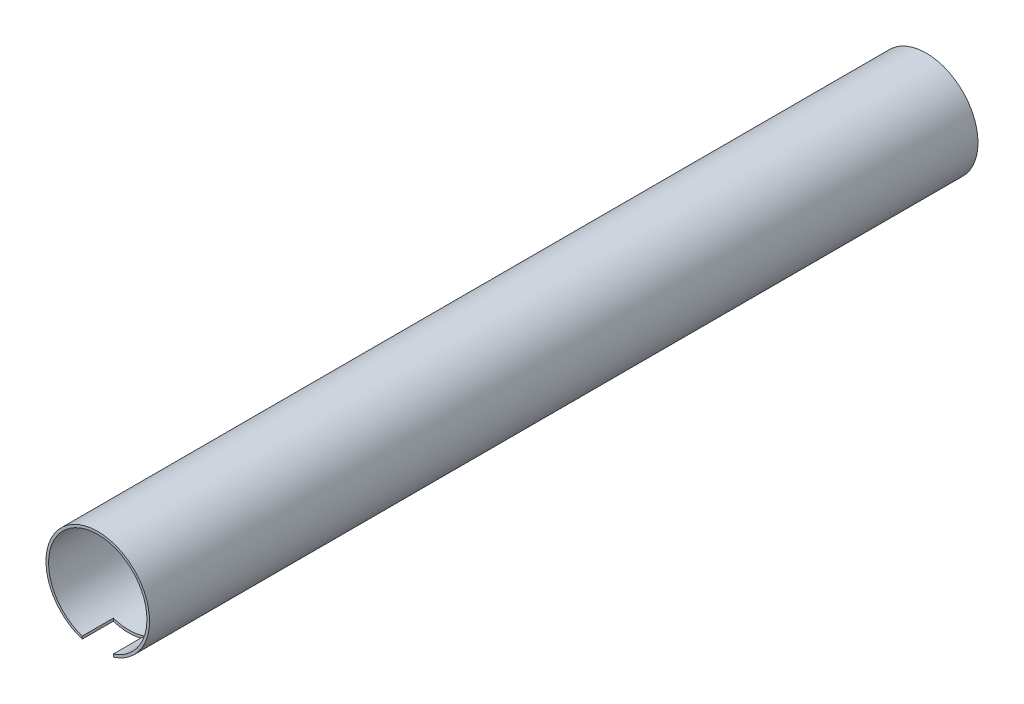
ISO-10303-21;
HEADER;
FILE_DESCRIPTION(('STEP AP214'),'2;1');
FILE_NAME('part.step','',(''),(''),'','','');
FILE_SCHEMA(('AUTOMOTIVE_DESIGN { 1 0 10303 214 1 1 1 1 }'));
ENDSEC;
DATA;
#1=APPLICATION_CONTEXT('core data for automotive mechanical design processes');
#2=APPLICATION_PROTOCOL_DEFINITION('international standard','automotive_design',2000,#1);
#3=PRODUCT_CONTEXT('',#1,'mechanical');
#4=PRODUCT('Part','Part','',(#3));
#5=PRODUCT_RELATED_PRODUCT_CATEGORY('part','',(#4));
#6=PRODUCT_DEFINITION_FORMATION('','',#4);
#7=PRODUCT_DEFINITION_CONTEXT('part definition',#1,'design');
#8=PRODUCT_DEFINITION('design','',#6,#7);
#9=PRODUCT_DEFINITION_SHAPE('','',#8);
#10=(LENGTH_UNIT() NAMED_UNIT(*) SI_UNIT(.MILLI.,.METRE.));
#11=(NAMED_UNIT(*) PLANE_ANGLE_UNIT() SI_UNIT($,.RADIAN.));
#12=(NAMED_UNIT(*) SI_UNIT($,.STERADIAN.) SOLID_ANGLE_UNIT());
#13=UNCERTAINTY_MEASURE_WITH_UNIT(LENGTH_MEASURE(1.E-05),#10,'distance_accuracy_value','');
#14=(GEOMETRIC_REPRESENTATION_CONTEXT(3) GLOBAL_UNCERTAINTY_ASSIGNED_CONTEXT((#13)) GLOBAL_UNIT_ASSIGNED_CONTEXT((#10,
#11,#12)) REPRESENTATION_CONTEXT('',''));
#15=CARTESIAN_POINT('',(0.,0.,0.));
#16=DIRECTION('',(0.,0.,1.));
#17=DIRECTION('',(1.,0.,0.));
#18=AXIS2_PLACEMENT_3D('',#15,#16,#17);
#19=CARTESIAN_POINT('',(0.,0.,800.));
#20=DIRECTION('',(0.,0.,1.));
#21=DIRECTION('',(1.,0.,0.));
#22=AXIS2_PLACEMENT_3D('',#19,#20,#21);
#23=PLANE('',#22);
#24=DIRECTION('',(0.,1.,0.));
#25=VECTOR('',#24,1.);
#26=CARTESIAN_POINT('',(-15.,-800.,800.));
#27=LINE('',#26,#25);
#28=CARTESIAN_POINT('',(-15.,-47.6969600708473,800.));
#29=VERTEX_POINT('',#28);
#30=CARTESIAN_POINT('',(-15.,-45.0693909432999,800.));
#31=VERTEX_POINT('',#30);
#32=EDGE_CURVE('E74',#29,#31,#27,.T.);
#33=ORIENTED_EDGE('',*,*,#32,.T.);
#34=CARTESIAN_POINT('',(0.,0.,800.));
#35=DIRECTION('',(0.,0.,1.));
#36=DIRECTION('',(1.,0.,0.));
#37=AXIS2_PLACEMENT_3D('',#34,#35,#36);
#38=CIRCLE('',#37,47.5);
#39=CARTESIAN_POINT('',(15.,-45.0693909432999,800.));
#40=VERTEX_POINT('',#39);
#41=EDGE_CURVE('E98',#40,#31,#38,.T.);
#42=ORIENTED_EDGE('',*,*,#41,.F.);
#43=DIRECTION('',(0.,1.,0.));
#44=VECTOR('',#43,1.);
#45=CARTESIAN_POINT('',(15.,-800.,800.));
#46=LINE('',#45,#44);
#47=CARTESIAN_POINT('',(15.,-47.6969600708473,800.));
#48=VERTEX_POINT('',#47);
#49=EDGE_CURVE('E49',#48,#40,#46,.T.);
#50=ORIENTED_EDGE('',*,*,#49,.F.);
#51=CARTESIAN_POINT('',(0.,0.,800.));
#52=DIRECTION('',(0.,0.,1.));
#53=DIRECTION('',(1.,0.,0.));
#54=AXIS2_PLACEMENT_3D('',#51,#52,#53);
#55=CIRCLE('',#54,50.);
#56=EDGE_CURVE('E89',#48,#29,#55,.T.);
#57=ORIENTED_EDGE('',*,*,#56,.T.);
#58=EDGE_LOOP('',(#33,#42,#50,#57));
#59=FACE_BOUND('',#58,.T.);
#60=ADVANCED_FACE('F34',(#59),#23,.T.);
#61=CARTESIAN_POINT('',(0.,0.,0.));
#62=DIRECTION('',(0.,0.,1.));
#63=DIRECTION('',(1.,0.,0.));
#64=AXIS2_PLACEMENT_3D('',#61,#62,#63);
#65=PLANE('',#64);
#66=CARTESIAN_POINT('',(0.,0.,0.));
#67=DIRECTION('',(0.,0.,1.));
#68=DIRECTION('',(1.,0.,0.));
#69=AXIS2_PLACEMENT_3D('',#66,#67,#68);
#70=CIRCLE('',#69,50.);
#71=CARTESIAN_POINT('',(50.,0.,0.));
#72=VERTEX_POINT('',#71);
#73=EDGE_CURVE('E94',#72,#72,#70,.T.);
#74=ORIENTED_EDGE('',*,*,#73,.F.);
#75=EDGE_LOOP('',(#74));
#76=FACE_BOUND('',#75,.T.);
#77=CARTESIAN_POINT('',(0.,0.,0.));
#78=DIRECTION('',(0.,0.,1.));
#79=DIRECTION('',(1.,0.,0.));
#80=AXIS2_PLACEMENT_3D('',#77,#78,#79);
#81=CIRCLE('',#80,47.5);
#82=CARTESIAN_POINT('',(47.5,0.,0.));
#83=VERTEX_POINT('',#82);
#84=EDGE_CURVE('E91',#83,#83,#81,.T.);
#85=ORIENTED_EDGE('',*,*,#84,.T.);
#86=EDGE_LOOP('',(#85));
#87=FACE_BOUND('',#86,.T.);
#88=ADVANCED_FACE('F126',(#76,#87),#65,.F.);
#89=CARTESIAN_POINT('',(0.,0.,800.));
#90=DIRECTION('',(0.,0.,-1.));
#91=DIRECTION('',(-1.,0.,0.));
#92=AXIS2_PLACEMENT_3D('',#89,#90,#91);
#93=CYLINDRICAL_SURFACE('',#92,50.);
#94=CARTESIAN_POINT('',(0.,0.,770.));
#95=DIRECTION('',(0.,0.,-1.));
#96=DIRECTION('',(-1.,0.,0.));
#97=AXIS2_PLACEMENT_3D('',#94,#95,#96);
#98=CIRCLE('',#97,50.);
#99=CARTESIAN_POINT('',(15.,-47.6969600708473,770.));
#100=VERTEX_POINT('',#99);
#101=CARTESIAN_POINT('',(-15.,-47.6969600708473,770.));
#102=VERTEX_POINT('',#101);
#103=EDGE_CURVE('E90',#100,#102,#98,.T.);
#104=ORIENTED_EDGE('',*,*,#103,.T.);
#105=DIRECTION('',(0.,0.,-1.));
#106=VECTOR('',#105,1.);
#107=CARTESIAN_POINT('',(-15.,-47.6969600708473,800.));
#108=LINE('',#107,#106);
#109=EDGE_CURVE('E77',#102,#29,#108,.F.);
#110=ORIENTED_EDGE('',*,*,#109,.T.);
#111=ORIENTED_EDGE('',*,*,#56,.F.);
#112=DIRECTION('',(0.,0.,-1.));
#113=VECTOR('',#112,1.);
#114=CARTESIAN_POINT('',(15.,-47.6969600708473,800.));
#115=LINE('',#114,#113);
#116=EDGE_CURVE('E105',#48,#100,#115,.T.);
#117=ORIENTED_EDGE('',*,*,#116,.T.);
#118=EDGE_LOOP('',(#104,#110,#111,#117));
#119=FACE_BOUND('',#118,.T.);
#120=ORIENTED_EDGE('',*,*,#73,.T.);
#121=EDGE_LOOP('',(#120));
#122=FACE_BOUND('',#121,.T.);
#123=ADVANCED_FACE('F36',(#119,#122),#93,.T.);
#124=CARTESIAN_POINT('',(0.,0.,800.));
#125=DIRECTION('',(0.,0.,-1.));
#126=DIRECTION('',(-1.,0.,0.));
#127=AXIS2_PLACEMENT_3D('',#124,#125,#126);
#128=CYLINDRICAL_SURFACE('',#127,47.5);
#129=DIRECTION('',(0.,0.,-1.));
#130=VECTOR('',#129,1.);
#131=CARTESIAN_POINT('',(-15.,-45.0693909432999,800.));
#132=LINE('',#131,#130);
#133=CARTESIAN_POINT('',(-15.,-45.0693909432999,770.));
#134=VERTEX_POINT('',#133);
#135=EDGE_CURVE('E11',#134,#31,#132,.F.);
#136=ORIENTED_EDGE('',*,*,#135,.F.);
#137=CARTESIAN_POINT('',(0.,0.,770.));
#138=DIRECTION('',(0.,0.,-1.));
#139=DIRECTION('',(-1.,0.,0.));
#140=AXIS2_PLACEMENT_3D('',#137,#138,#139);
#141=CIRCLE('',#140,47.5);
#142=CARTESIAN_POINT('',(15.,-45.0693909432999,770.));
#143=VERTEX_POINT('',#142);
#144=EDGE_CURVE('E42',#143,#134,#141,.T.);
#145=ORIENTED_EDGE('',*,*,#144,.F.);
#146=DIRECTION('',(0.,0.,-1.));
#147=VECTOR('',#146,1.);
#148=CARTESIAN_POINT('',(15.,-45.0693909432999,800.));
#149=LINE('',#148,#147);
#150=EDGE_CURVE('E93',#40,#143,#149,.T.);
#151=ORIENTED_EDGE('',*,*,#150,.F.);
#152=ORIENTED_EDGE('',*,*,#41,.T.);
#153=EDGE_LOOP('',(#136,#145,#151,#152));
#154=FACE_BOUND('',#153,.T.);
#155=ORIENTED_EDGE('',*,*,#84,.F.);
#156=EDGE_LOOP('',(#155));
#157=FACE_BOUND('',#156,.T.);
#158=ADVANCED_FACE('F112',(#154,#157),#128,.F.);
#159=CARTESIAN_POINT('',(-15.,-800.,800.));
#160=DIRECTION('',(-1.,0.,0.));
#161=DIRECTION('',(0.,0.,1.));
#162=AXIS2_PLACEMENT_3D('',#159,#160,#161);
#163=PLANE('',#162);
#164=DIRECTION('',(0.,1.,0.));
#165=VECTOR('',#164,1.);
#166=CARTESIAN_POINT('',(-15.,-800.,770.));
#167=LINE('',#166,#165);
#168=EDGE_CURVE('E106',#102,#134,#167,.T.);
#169=ORIENTED_EDGE('',*,*,#168,.T.);
#170=ORIENTED_EDGE('',*,*,#135,.T.);
#171=ORIENTED_EDGE('',*,*,#32,.F.);
#172=ORIENTED_EDGE('',*,*,#109,.F.);
#173=EDGE_LOOP('',(#169,#170,#171,#172));
#174=FACE_BOUND('',#173,.T.);
#175=ADVANCED_FACE('F76',(#174),#163,.F.);
#176=CARTESIAN_POINT('',(-15.,-800.,770.));
#177=DIRECTION('',(0.,0.,-1.));
#178=DIRECTION('',(-1.,0.,0.));
#179=AXIS2_PLACEMENT_3D('',#176,#177,#178);
#180=PLANE('',#179);
#181=DIRECTION('',(0.,1.,0.));
#182=VECTOR('',#181,1.);
#183=CARTESIAN_POINT('',(15.,-800.,770.));
#184=LINE('',#183,#182);
#185=EDGE_CURVE('E109',#100,#143,#184,.T.);
#186=ORIENTED_EDGE('',*,*,#185,.T.);
#187=ORIENTED_EDGE('',*,*,#144,.T.);
#188=ORIENTED_EDGE('',*,*,#168,.F.);
#189=ORIENTED_EDGE('',*,*,#103,.F.);
#190=EDGE_LOOP('',(#186,#187,#188,#189));
#191=FACE_BOUND('',#190,.T.);
#192=ADVANCED_FACE('F116',(#191),#180,.F.);
#193=CARTESIAN_POINT('',(15.,-800.,800.));
#194=DIRECTION('',(1.,0.,0.));
#195=DIRECTION('',(0.,0.,-1.));
#196=AXIS2_PLACEMENT_3D('',#193,#194,#195);
#197=PLANE('',#196);
#198=ORIENTED_EDGE('',*,*,#49,.T.);
#199=ORIENTED_EDGE('',*,*,#150,.T.);
#200=ORIENTED_EDGE('',*,*,#185,.F.);
#201=ORIENTED_EDGE('',*,*,#116,.F.);
#202=EDGE_LOOP('',(#198,#199,#200,#201));
#203=FACE_BOUND('',#202,.T.);
#204=ADVANCED_FACE('F115',(#203),#197,.F.);
#205=CLOSED_SHELL('',(#60,#88,#123,#158,#175,#192,#204));
#206=MANIFOLD_SOLID_BREP('B2',#205);
#207=ADVANCED_BREP_SHAPE_REPRESENTATION('',(#18,#206),#14);
#208=SHAPE_DEFINITION_REPRESENTATION(#9,#207);
ENDSEC;
END-ISO-10303-21;
